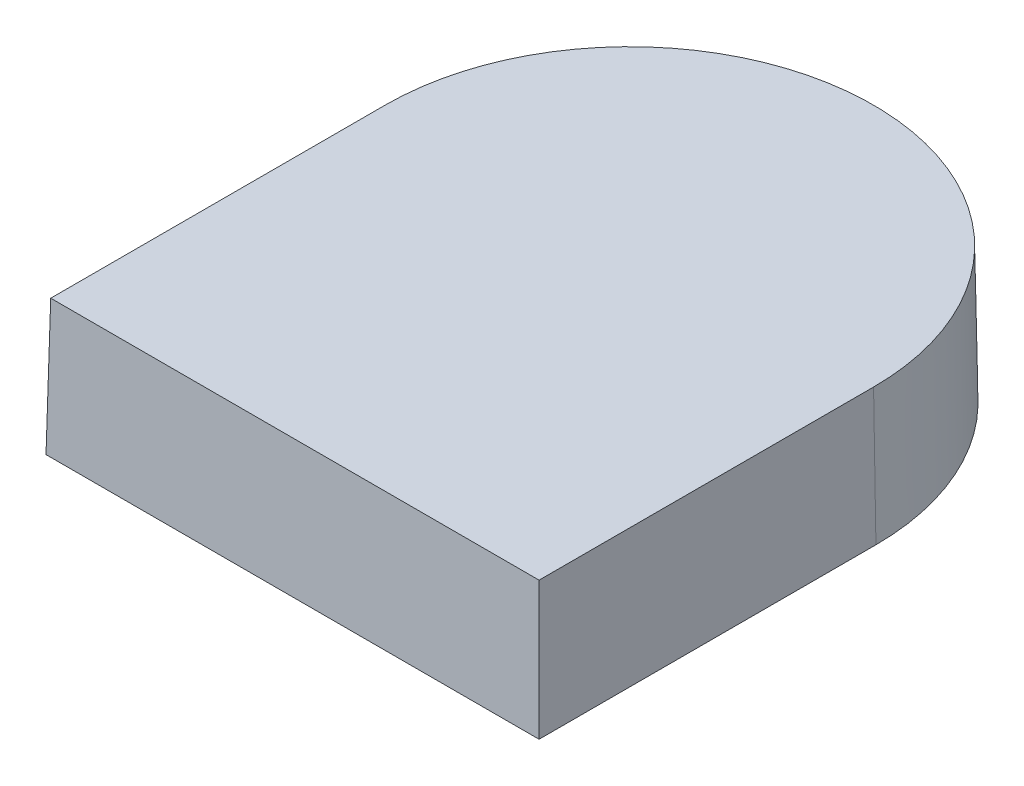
ISO-10303-21;
HEADER;
FILE_DESCRIPTION(('STEP AP214'),'2;1');
FILE_NAME('part.step','',(''),(''),'','','');
FILE_SCHEMA(('AUTOMOTIVE_DESIGN { 1 0 10303 214 1 1 1 1 }'));
ENDSEC;
DATA;
#1=APPLICATION_CONTEXT('core data for automotive mechanical design processes');
#2=APPLICATION_PROTOCOL_DEFINITION('international standard','automotive_design',2000,#1);
#3=PRODUCT_CONTEXT('',#1,'mechanical');
#4=PRODUCT('Part','Part','',(#3));
#5=PRODUCT_RELATED_PRODUCT_CATEGORY('part','',(#4));
#6=PRODUCT_DEFINITION_FORMATION('','',#4);
#7=PRODUCT_DEFINITION_CONTEXT('part definition',#1,'design');
#8=PRODUCT_DEFINITION('design','',#6,#7);
#9=PRODUCT_DEFINITION_SHAPE('','',#8);
#10=(LENGTH_UNIT() NAMED_UNIT(*) SI_UNIT(.MILLI.,.METRE.));
#11=(NAMED_UNIT(*) PLANE_ANGLE_UNIT() SI_UNIT($,.RADIAN.));
#12=(NAMED_UNIT(*) SI_UNIT($,.STERADIAN.) SOLID_ANGLE_UNIT());
#13=UNCERTAINTY_MEASURE_WITH_UNIT(LENGTH_MEASURE(1.E-05),#10,'distance_accuracy_value','');
#14=(GEOMETRIC_REPRESENTATION_CONTEXT(3) GLOBAL_UNCERTAINTY_ASSIGNED_CONTEXT((#13)) GLOBAL_UNIT_ASSIGNED_CONTEXT((#10,
#11,#12)) REPRESENTATION_CONTEXT('',''));
#15=CARTESIAN_POINT('',(0.,0.,0.));
#16=DIRECTION('',(0.,0.,1.));
#17=DIRECTION('',(1.,0.,0.));
#18=AXIS2_PLACEMENT_3D('',#15,#16,#17);
#19=CARTESIAN_POINT('',(0.,0.,-2.14999999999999));
#20=DIRECTION('',(0.,-1.,0.));
#21=DIRECTION('',(0.,0.,-1.));
#22=AXIS2_PLACEMENT_3D('',#19,#20,#21);
#23=CONICAL_SURFACE('',#22,13.65,0.0174532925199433);
#24=CARTESIAN_POINT('',(0.,0.,-2.14999999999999));
#25=DIRECTION('',(0.,1.,0.));
#26=DIRECTION('',(0.,0.,-1.));
#27=AXIS2_PLACEMENT_3D('',#24,#25,#26);
#28=CIRCLE('',#27,13.65);
#29=CARTESIAN_POINT('',(13.65,0.,-2.15000000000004));
#30=VERTEX_POINT('',#29);
#31=CARTESIAN_POINT('',(-13.65,0.,-2.14999999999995));
#32=VERTEX_POINT('',#31);
#33=EDGE_CURVE('E84',#30,#32,#28,.T.);
#34=ORIENTED_EDGE('',*,*,#33,.T.);
#35=DIRECTION('',(-0.0174524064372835,-0.999847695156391,0.));
#36=VECTOR('',#35,1.);
#37=CARTESIAN_POINT('',(-13.65,0.,-2.14999999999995));
#38=LINE('',#37,#36);
#39=CARTESIAN_POINT('',(-13.5190870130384,7.5,-2.14999999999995));
#40=VERTEX_POINT('',#39);
#41=EDGE_CURVE('E11',#40,#32,#38,.T.);
#42=ORIENTED_EDGE('',*,*,#41,.F.);
#43=CARTESIAN_POINT('',(0.,7.5,-2.14999999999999));
#44=DIRECTION('',(0.,-1.,0.));
#45=DIRECTION('',(0.,0.,-1.));
#46=AXIS2_PLACEMENT_3D('',#43,#44,#45);
#47=CIRCLE('',#46,13.5190870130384);
#48=CARTESIAN_POINT('',(13.5190870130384,7.5,-2.15000000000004));
#49=VERTEX_POINT('',#48);
#50=EDGE_CURVE('E100',#49,#40,#47,.F.);
#51=ORIENTED_EDGE('',*,*,#50,.F.);
#52=DIRECTION('',(0.0174524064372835,-0.999847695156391,0.));
#53=VECTOR('',#52,1.);
#54=CARTESIAN_POINT('',(13.65,0.,-2.15000000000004));
#55=LINE('',#54,#53);
#56=EDGE_CURVE('E95',#49,#30,#55,.T.);
#57=ORIENTED_EDGE('',*,*,#56,.T.);
#58=EDGE_LOOP('',(#34,#42,#51,#57));
#59=FACE_BOUND('',#58,.T.);
#60=ADVANCED_FACE('F38',(#59),#23,.T.);
#61=CARTESIAN_POINT('',(-13.65,0.,16.5));
#62=DIRECTION('',(-0.999847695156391,0.0174524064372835,0.));
#63=DIRECTION('',(-0.0174524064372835,-0.999847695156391,0.));
#64=AXIS2_PLACEMENT_3D('',#61,#62,#63);
#65=PLANE('',#64);
#66=DIRECTION('',(0.,0.,1.));
#67=VECTOR('',#66,1.);
#68=CARTESIAN_POINT('',(-13.65,0.,16.5));
#69=LINE('',#68,#67);
#70=CARTESIAN_POINT('',(-13.65,0.,16.5));
#71=VERTEX_POINT('',#70);
#72=EDGE_CURVE('E80',#32,#71,#69,.T.);
#73=ORIENTED_EDGE('',*,*,#72,.T.);
#74=DIRECTION('',(-0.0174497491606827,-0.999695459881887,0.0174497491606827));
#75=VECTOR('',#74,1.);
#76=CARTESIAN_POINT('',(-13.6416873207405,0.476233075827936,16.4916873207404));
#77=LINE('',#76,#75);
#78=CARTESIAN_POINT('',(-13.5190870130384,7.5,16.3690870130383));
#79=VERTEX_POINT('',#78);
#80=EDGE_CURVE('E47',#79,#71,#77,.T.);
#81=ORIENTED_EDGE('',*,*,#80,.F.);
#82=DIRECTION('',(0.,0.,-1.));
#83=VECTOR('',#82,1.);
#84=CARTESIAN_POINT('',(-13.5190870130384,7.5,-2.14999999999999));
#85=LINE('',#84,#83);
#86=EDGE_CURVE('E91',#40,#79,#85,.F.);
#87=ORIENTED_EDGE('',*,*,#86,.F.);
#88=ORIENTED_EDGE('',*,*,#41,.T.);
#89=EDGE_LOOP('',(#73,#81,#87,#88));
#90=FACE_BOUND('',#89,.T.);
#91=ADVANCED_FACE('F40',(#90),#65,.T.);
#92=CARTESIAN_POINT('',(13.65,0.,16.5));
#93=DIRECTION('',(0.,0.0174524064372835,0.999847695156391));
#94=DIRECTION('',(0.,-0.999847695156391,0.0174524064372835));
#95=AXIS2_PLACEMENT_3D('',#92,#93,#94);
#96=PLANE('',#95);
#97=DIRECTION('',(1.,0.,0.));
#98=VECTOR('',#97,1.);
#99=CARTESIAN_POINT('',(13.65,0.,16.5));
#100=LINE('',#99,#98);
#101=CARTESIAN_POINT('',(13.65,0.,16.5));
#102=VERTEX_POINT('',#101);
#103=EDGE_CURVE('E85',#71,#102,#100,.T.);
#104=ORIENTED_EDGE('',*,*,#103,.T.);
#105=DIRECTION('',(0.0174497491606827,-0.999695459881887,0.0174497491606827));
#106=VECTOR('',#105,1.);
#107=CARTESIAN_POINT('',(13.6443211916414,0.32533871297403,16.4943211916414));
#108=LINE('',#107,#106);
#109=CARTESIAN_POINT('',(13.5190870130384,7.5,16.3690870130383));
#110=VERTEX_POINT('',#109);
#111=EDGE_CURVE('E103',#110,#102,#108,.T.);
#112=ORIENTED_EDGE('',*,*,#111,.F.);
#113=DIRECTION('',(-1.,0.,0.));
#114=VECTOR('',#113,1.);
#115=CARTESIAN_POINT('',(0.,7.5,16.3690870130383));
#116=LINE('',#115,#114);
#117=EDGE_CURVE('E59',#79,#110,#116,.F.);
#118=ORIENTED_EDGE('',*,*,#117,.F.);
#119=ORIENTED_EDGE('',*,*,#80,.T.);
#120=EDGE_LOOP('',(#104,#112,#118,#119));
#121=FACE_BOUND('',#120,.T.);
#122=ADVANCED_FACE('F110',(#121),#96,.T.);
#123=CARTESIAN_POINT('',(13.65,0.,-2.15000000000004));
#124=DIRECTION('',(0.999847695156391,0.0174524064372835,0.));
#125=DIRECTION('',(-0.0174524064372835,0.999847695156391,0.));
#126=AXIS2_PLACEMENT_3D('',#123,#124,#125);
#127=PLANE('',#126);
#128=DIRECTION('',(0.,0.,-1.));
#129=VECTOR('',#128,1.);
#130=CARTESIAN_POINT('',(13.65,0.,-2.15000000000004));
#131=LINE('',#130,#129);
#132=EDGE_CURVE('E99',#102,#30,#131,.T.);
#133=ORIENTED_EDGE('',*,*,#132,.T.);
#134=ORIENTED_EDGE('',*,*,#56,.F.);
#135=DIRECTION('',(0.,0.,1.));
#136=VECTOR('',#135,1.);
#137=CARTESIAN_POINT('',(13.5190870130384,7.5,-2.15));
#138=LINE('',#137,#136);
#139=EDGE_CURVE('E42',#110,#49,#138,.F.);
#140=ORIENTED_EDGE('',*,*,#139,.F.);
#141=ORIENTED_EDGE('',*,*,#111,.T.);
#142=EDGE_LOOP('',(#133,#134,#140,#141));
#143=FACE_BOUND('',#142,.T.);
#144=ADVANCED_FACE('F112',(#143),#127,.T.);
#145=CARTESIAN_POINT('',(0.,7.5,-2.14999999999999));
#146=DIRECTION('',(0.,-1.,0.));
#147=DIRECTION('',(0.,0.,-1.));
#148=AXIS2_PLACEMENT_3D('',#145,#146,#147);
#149=PLANE('',#148);
#150=ORIENTED_EDGE('',*,*,#50,.T.);
#151=ORIENTED_EDGE('',*,*,#86,.T.);
#152=ORIENTED_EDGE('',*,*,#117,.T.);
#153=ORIENTED_EDGE('',*,*,#139,.T.);
#154=EDGE_LOOP('',(#150,#151,#152,#153));
#155=FACE_BOUND('',#154,.T.);
#156=ADVANCED_FACE('F108',(#155),#149,.F.);
#157=CARTESIAN_POINT('',(0.,0.,-2.14999999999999));
#158=DIRECTION('',(0.,-1.,0.));
#159=DIRECTION('',(0.,0.,-1.));
#160=AXIS2_PLACEMENT_3D('',#157,#158,#159);
#161=PLANE('',#160);
#162=ORIENTED_EDGE('',*,*,#33,.F.);
#163=ORIENTED_EDGE('',*,*,#132,.F.);
#164=ORIENTED_EDGE('',*,*,#103,.F.);
#165=ORIENTED_EDGE('',*,*,#72,.F.);
#166=EDGE_LOOP('',(#162,#163,#164,#165));
#167=FACE_BOUND('',#166,.T.);
#168=ADVANCED_FACE('F81',(#167),#161,.T.);
#169=CLOSED_SHELL('',(#60,#91,#122,#144,#156,#168));
#170=MANIFOLD_SOLID_BREP('B2',#169);
#171=ADVANCED_BREP_SHAPE_REPRESENTATION('',(#18,#170),#14);
#172=SHAPE_DEFINITION_REPRESENTATION(#9,#171);
ENDSEC;
END-ISO-10303-21;
